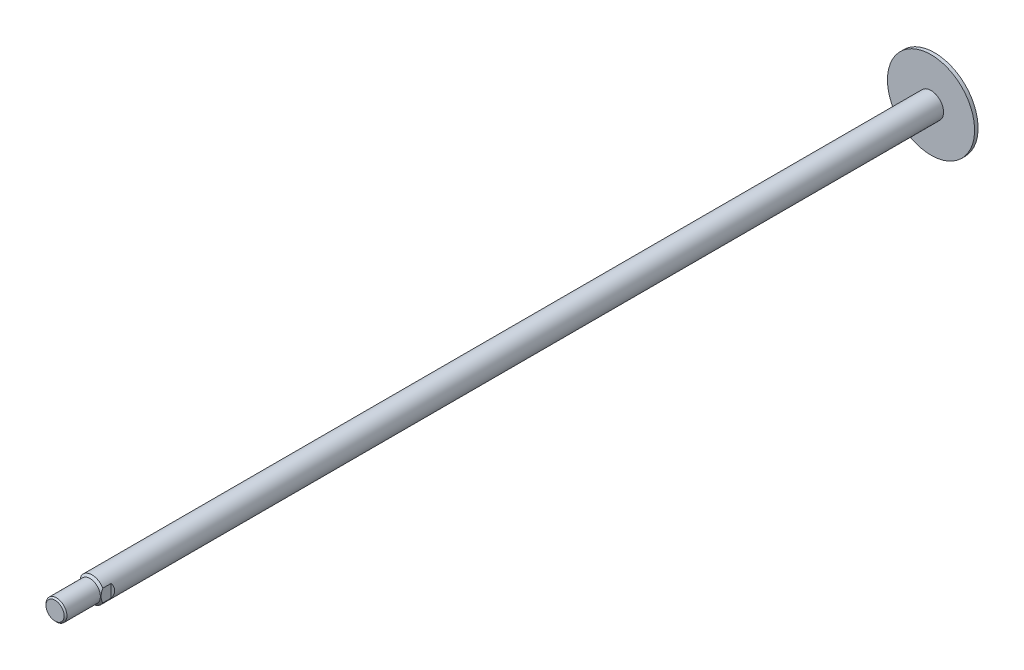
from build123d import *

# Parameters (mm, degrees)
SKETCH1_R          = 18
BASE_EXTRUDE_DEPTH = 1261.5
SKETCH2_R          = 62.5
PISTON_DEPTH       = 5
FLATS_DEPTH        = 1265.592720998
FLATS_DEPTH_BACK   = 1265.592720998


with BuildPart() as part:
    # Sketch1 → Base-Extrude (new body)
    with BuildSketch(Plane.XY):
        with Locations(Location((0, 0, 0), (0, 0, 180))):
            Circle(SKETCH1_R)
    extrude(amount=BASE_EXTRUDE_DEPTH)

    # Sketch2 → Piston (add)
    with BuildSketch(Plane(origin=(0, 0, 0), x_dir=(-1, 0, 0), z_dir=(0, 0, -1))):
        Circle(SKETCH2_R)
    extrude(amount=-PISTON_DEPTH)

    # Sketch3 → Thread (revolve, cut)
    with BuildSketch(Plane(origin=(0, 0, 0), x_dir=(0, 0, -1), z_dir=(1, 0, 0)), mode=Mode.PRIVATE) as thread_sk:
        Polygon((-1261.5, 18), (-1261.5, 13), (-1259.5, 15), (-1211.5, 15), (-1208.5, 18), align=None)
    revolve(thread_sk.sketch.rotate(Axis((0, 0, 0), (0, 0, 1)), 90), axis=Axis((0, 0, 0), (0, 0, 1)), mode=Mode.SUBTRACT)

    # Sketch4 → Flats (cut, two sides: drawn at the far end of the back side and taken through both)
    with BuildSketch(Plane(origin=(0, 0, 0), x_dir=(1, 0, 0), z_dir=(0, 1, 0)).offset(-FLATS_DEPTH_BACK)):
        Polygon((18, -1194), (15.5, -1196.5), (15.5, -1261.5), (18, -1261.5), align=None)
        Polygon((-18, -1261.5), (-18, -1194), (-15.5, -1196.5), (-15.5, -1261.5), align=None)
    extrude(amount=FLATS_DEPTH + FLATS_DEPTH_BACK, mode=Mode.SUBTRACT)


solid = part.part
